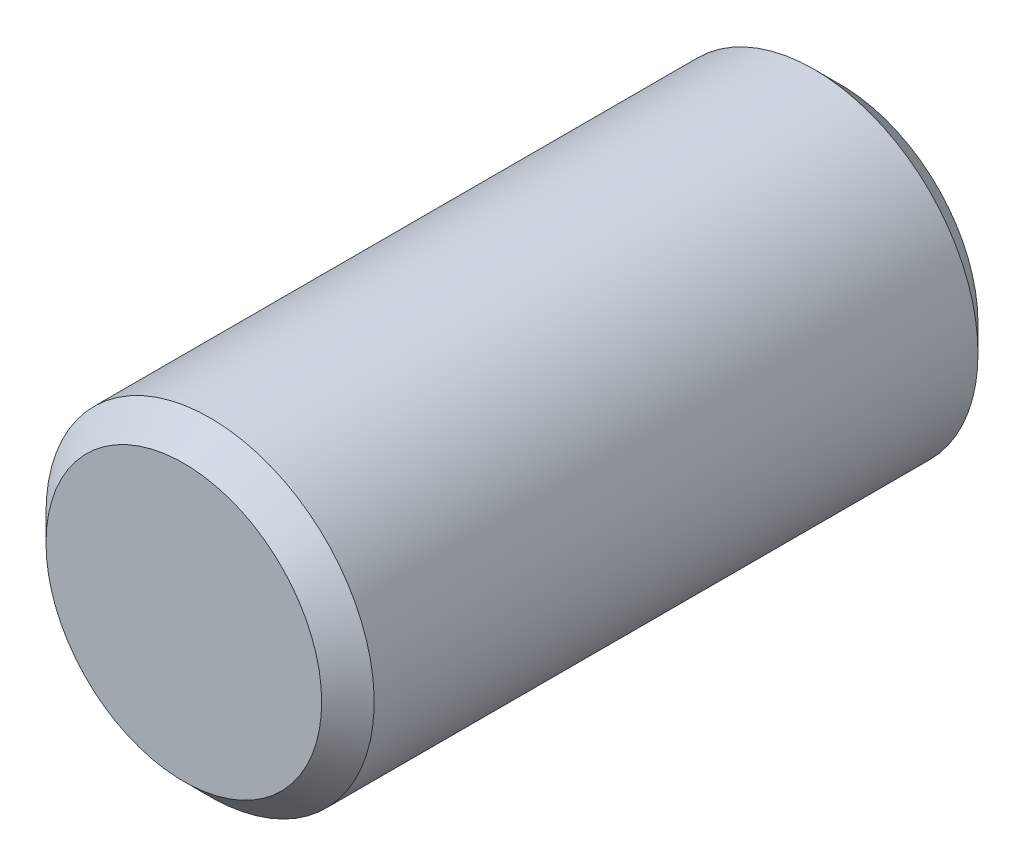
ISO-10303-21;
HEADER;
FILE_DESCRIPTION(('STEP AP214'),'2;1');
FILE_NAME('part.step','',(''),(''),'','','');
FILE_SCHEMA(('AUTOMOTIVE_DESIGN { 1 0 10303 214 1 1 1 1 }'));
ENDSEC;
DATA;
#1=APPLICATION_CONTEXT('core data for automotive mechanical design processes');
#2=APPLICATION_PROTOCOL_DEFINITION('international standard','automotive_design',2000,#1);
#3=PRODUCT_CONTEXT('',#1,'mechanical');
#4=PRODUCT('Part','Part','',(#3));
#5=PRODUCT_RELATED_PRODUCT_CATEGORY('part','',(#4));
#6=PRODUCT_DEFINITION_FORMATION('','',#4);
#7=PRODUCT_DEFINITION_CONTEXT('part definition',#1,'design');
#8=PRODUCT_DEFINITION('design','',#6,#7);
#9=PRODUCT_DEFINITION_SHAPE('','',#8);
#10=(LENGTH_UNIT() NAMED_UNIT(*) SI_UNIT(.MILLI.,.METRE.));
#11=(NAMED_UNIT(*) PLANE_ANGLE_UNIT() SI_UNIT($,.RADIAN.));
#12=(NAMED_UNIT(*) SI_UNIT($,.STERADIAN.) SOLID_ANGLE_UNIT());
#13=UNCERTAINTY_MEASURE_WITH_UNIT(LENGTH_MEASURE(1.E-05),#10,'distance_accuracy_value','');
#14=(GEOMETRIC_REPRESENTATION_CONTEXT(3) GLOBAL_UNCERTAINTY_ASSIGNED_CONTEXT((#13)) GLOBAL_UNIT_ASSIGNED_CONTEXT((#10,
#11,#12)) REPRESENTATION_CONTEXT('',''));
#15=CARTESIAN_POINT('',(0.,0.,0.));
#16=DIRECTION('',(0.,0.,1.));
#17=DIRECTION('',(1.,0.,0.));
#18=AXIS2_PLACEMENT_3D('',#15,#16,#17);
#19=CARTESIAN_POINT('',(0.,0.,5.));
#20=DIRECTION('',(0.,0.,-1.));
#21=DIRECTION('',(-1.,0.,0.));
#22=AXIS2_PLACEMENT_3D('',#19,#20,#21);
#23=CYLINDRICAL_SURFACE('',#22,1.25);
#24=CARTESIAN_POINT('',(0.,0.,0.200000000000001));
#25=DIRECTION('',(0.,0.,1.));
#26=DIRECTION('',(1.,0.,0.));
#27=AXIS2_PLACEMENT_3D('',#24,#25,#26);
#28=CIRCLE('',#27,1.25);
#29=CARTESIAN_POINT('',(1.25,0.,0.200000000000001));
#30=VERTEX_POINT('',#29);
#31=EDGE_CURVE('E371',#30,#30,#28,.T.);
#32=ORIENTED_EDGE('',*,*,#31,.T.);
#33=EDGE_LOOP('',(#32));
#34=FACE_BOUND('',#33,.T.);
#35=CARTESIAN_POINT('',(0.,0.,4.8));
#36=DIRECTION('',(0.,0.,1.));
#37=DIRECTION('',(1.,0.,0.));
#38=AXIS2_PLACEMENT_3D('',#35,#36,#37);
#39=CIRCLE('',#38,1.25);
#40=CARTESIAN_POINT('',(-1.25,0.,4.8));
#41=VERTEX_POINT('',#40);
#42=EDGE_CURVE('E375',#41,#41,#39,.F.);
#43=ORIENTED_EDGE('',*,*,#42,.T.);
#44=EDGE_LOOP('',(#43));
#45=FACE_BOUND('',#44,.T.);
#46=ADVANCED_FACE('F361',(#34,#45),#23,.T.);
#47=CARTESIAN_POINT('',(0.,0.,5.));
#48=DIRECTION('',(0.,0.,1.));
#49=DIRECTION('',(1.,0.,0.));
#50=AXIS2_PLACEMENT_3D('',#47,#48,#49);
#51=PLANE('',#50);
#52=CARTESIAN_POINT('',(0.,0.,5.));
#53=DIRECTION('',(0.,0.,1.));
#54=DIRECTION('',(1.,0.,0.));
#55=AXIS2_PLACEMENT_3D('',#52,#53,#54);
#56=CIRCLE('',#55,1.05);
#57=CARTESIAN_POINT('',(-1.05,0.,5.));
#58=VERTEX_POINT('',#57);
#59=EDGE_CURVE('E10',#58,#58,#56,.T.);
#60=ORIENTED_EDGE('',*,*,#59,.T.);
#61=EDGE_LOOP('',(#60));
#62=FACE_BOUND('',#61,.T.);
#63=ADVANCED_FACE('F394',(#62),#51,.T.);
#64=CARTESIAN_POINT('',(0.,0.,0.));
#65=DIRECTION('',(0.,0.,1.));
#66=DIRECTION('',(1.,0.,0.));
#67=AXIS2_PLACEMENT_3D('',#64,#65,#66);
#68=PLANE('',#67);
#69=CARTESIAN_POINT('',(0.,0.,0.));
#70=DIRECTION('',(0.,0.,1.));
#71=DIRECTION('',(1.,0.,0.));
#72=AXIS2_PLACEMENT_3D('',#69,#70,#71);
#73=CIRCLE('',#72,1.05);
#74=CARTESIAN_POINT('',(1.05,0.,0.));
#75=VERTEX_POINT('',#74);
#76=EDGE_CURVE('E367',#75,#75,#73,.F.);
#77=ORIENTED_EDGE('',*,*,#76,.T.);
#78=EDGE_LOOP('',(#77));
#79=FACE_BOUND('',#78,.T.);
#80=ADVANCED_FACE('F390',(#79),#68,.F.);
#81=CARTESIAN_POINT('',(0.,0.,0.200000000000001));
#82=DIRECTION('',(0.,0.,1.));
#83=DIRECTION('',(1.,0.,0.));
#84=AXIS2_PLACEMENT_3D('',#81,#82,#83);
#85=CONICAL_SURFACE('',#84,1.25,0.785398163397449);
#86=ORIENTED_EDGE('',*,*,#76,.F.);
#87=EDGE_LOOP('',(#86));
#88=FACE_BOUND('',#87,.T.);
#89=ORIENTED_EDGE('',*,*,#31,.F.);
#90=EDGE_LOOP('',(#89));
#91=FACE_BOUND('',#90,.T.);
#92=ADVANCED_FACE('F385',(#88,#91),#85,.T.);
#93=CARTESIAN_POINT('',(0.,0.,5.));
#94=DIRECTION('',(0.,0.,-1.));
#95=DIRECTION('',(-1.,0.,0.));
#96=AXIS2_PLACEMENT_3D('',#93,#94,#95);
#97=CONICAL_SURFACE('',#96,1.05,0.785398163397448);
#98=CARTESIAN_POINT('',(-1.25,0.,4.8));
#99=CARTESIAN_POINT('',(-1.24791666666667,0.,4.80208333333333));
#100=CARTESIAN_POINT('',(-1.24583333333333,0.,4.80416666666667));
#101=CARTESIAN_POINT('',(-1.24166666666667,0.,4.80833333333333));
#102=CARTESIAN_POINT('',(-1.23958333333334,0.,4.81041666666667));
#103=CARTESIAN_POINT('',(-1.23541666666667,0.,4.81458333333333));
#104=CARTESIAN_POINT('',(-1.23333333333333,0.,4.81666666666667));
#105=CARTESIAN_POINT('',(-1.22916666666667,0.,4.82083333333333));
#106=CARTESIAN_POINT('',(-1.22708333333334,0.,4.82291666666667));
#107=CARTESIAN_POINT('',(-1.22291666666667,0.,4.82708333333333));
#108=CARTESIAN_POINT('',(-1.22083333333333,0.,4.82916666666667));
#109=CARTESIAN_POINT('',(-1.21666666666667,0.,4.83333333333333));
#110=CARTESIAN_POINT('',(-1.21458333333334,0.,4.83541666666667));
#111=CARTESIAN_POINT('',(-1.21041666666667,0.,4.83958333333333));
#112=CARTESIAN_POINT('',(-1.20833333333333,0.,4.84166666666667));
#113=CARTESIAN_POINT('',(-1.20416666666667,0.,4.84583333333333));
#114=CARTESIAN_POINT('',(-1.20208333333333,0.,4.84791666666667));
#115=CARTESIAN_POINT('',(-1.19791666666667,0.,4.85208333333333));
#116=CARTESIAN_POINT('',(-1.19583333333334,0.,4.85416666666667));
#117=CARTESIAN_POINT('',(-1.19166666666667,0.,4.85833333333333));
#118=CARTESIAN_POINT('',(-1.18958333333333,0.,4.86041666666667));
#119=CARTESIAN_POINT('',(-1.18541666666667,0.,4.86458333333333));
#120=CARTESIAN_POINT('',(-1.18333333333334,0.,4.86666666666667));
#121=CARTESIAN_POINT('',(-1.17916666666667,0.,4.87083333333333));
#122=CARTESIAN_POINT('',(-1.17708333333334,0.,4.87291666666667));
#123=CARTESIAN_POINT('',(-1.17291666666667,0.,4.87708333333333));
#124=CARTESIAN_POINT('',(-1.17083333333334,0.,4.87916666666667));
#125=CARTESIAN_POINT('',(-1.16666666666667,0.,4.88333333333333));
#126=CARTESIAN_POINT('',(-1.16458333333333,0.,4.88541666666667));
#127=CARTESIAN_POINT('',(-1.16041666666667,0.,4.88958333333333));
#128=CARTESIAN_POINT('',(-1.15833333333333,0.,4.89166666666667));
#129=CARTESIAN_POINT('',(-1.15416666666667,0.,4.89583333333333));
#130=CARTESIAN_POINT('',(-1.15208333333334,0.,4.89791666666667));
#131=CARTESIAN_POINT('',(-1.14791666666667,0.,4.90208333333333));
#132=CARTESIAN_POINT('',(-1.14583333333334,0.,4.90416666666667));
#133=CARTESIAN_POINT('',(-1.14166666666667,0.,4.90833333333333));
#134=CARTESIAN_POINT('',(-1.13958333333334,0.,4.91041666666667));
#135=CARTESIAN_POINT('',(-1.13541666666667,0.,4.91458333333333));
#136=CARTESIAN_POINT('',(-1.13333333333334,0.,4.91666666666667));
#137=CARTESIAN_POINT('',(-1.12916666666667,0.,4.92083333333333));
#138=CARTESIAN_POINT('',(-1.12708333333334,0.,4.92291666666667));
#139=CARTESIAN_POINT('',(-1.12291666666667,0.,4.92708333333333));
#140=CARTESIAN_POINT('',(-1.12083333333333,0.,4.92916666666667));
#141=CARTESIAN_POINT('',(-1.11666666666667,0.,4.93333333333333));
#142=CARTESIAN_POINT('',(-1.11458333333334,0.,4.93541666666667));
#143=CARTESIAN_POINT('',(-1.11041666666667,0.,4.93958333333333));
#144=CARTESIAN_POINT('',(-1.10833333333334,0.,4.94166666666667));
#145=CARTESIAN_POINT('',(-1.10416666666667,0.,4.94583333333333));
#146=CARTESIAN_POINT('',(-1.10208333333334,0.,4.94791666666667));
#147=CARTESIAN_POINT('',(-1.09791666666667,0.,4.95208333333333));
#148=CARTESIAN_POINT('',(-1.09583333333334,0.,4.95416666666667));
#149=CARTESIAN_POINT('',(-1.09166666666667,0.,4.95833333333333));
#150=CARTESIAN_POINT('',(-1.08958333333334,0.,4.96041666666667));
#151=CARTESIAN_POINT('',(-1.08541666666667,0.,4.96458333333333));
#152=CARTESIAN_POINT('',(-1.08333333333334,0.,4.96666666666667));
#153=CARTESIAN_POINT('',(-1.07916666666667,0.,4.97083333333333));
#154=CARTESIAN_POINT('',(-1.07708333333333,0.,4.97291666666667));
#155=CARTESIAN_POINT('',(-1.07291666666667,0.,4.97708333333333));
#156=CARTESIAN_POINT('',(-1.07083333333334,0.,4.97916666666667));
#157=CARTESIAN_POINT('',(-1.06666666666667,0.,4.98333333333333));
#158=CARTESIAN_POINT('',(-1.06458333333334,0.,4.98541666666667));
#159=CARTESIAN_POINT('',(-1.06041666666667,0.,4.98958333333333));
#160=CARTESIAN_POINT('',(-1.05833333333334,0.,4.99166666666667));
#161=CARTESIAN_POINT('',(-1.05416666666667,0.,4.99583333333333));
#162=CARTESIAN_POINT('',(-1.05208333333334,0.,4.99791666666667));
#163=CARTESIAN_POINT('',(-1.05,0.,5.));
#164=B_SPLINE_CURVE_WITH_KNOTS('',3,(#98,#99,#100,#101,#102,#103,#104,#105,#106,#107,#108,#109,
#110,#111,#112,#113,#114,#115,#116,#117,#118,#119,#120,#121,#122,#123,#124,#125,#126,#127,#128,
#129,#130,#131,#132,#133,#134,#135,#136,#137,#138,#139,#140,#141,#142,#143,#144,#145,#146,#147,
#148,#149,#150,#151,#152,#153,#154,#155,#156,#157,#158,#159,#160,#161,#162,#163),.UNSPECIFIED.,
.F.,.F.,(4,2,2,2,2,2,2,2,2,2,2,2,2,2,2,2,2,2,2,2,2,2,2,2,2,2,2,2,2,2,2,2,4),(0.,
0.00883883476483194,0.0176776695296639,0.0265165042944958,0.0353553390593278,0.0441941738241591,
0.053033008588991,0.0618718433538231,0.0707106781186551,0.079549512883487,0.0883883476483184,
0.0972271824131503,0.106066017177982,0.114904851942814,0.123743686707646,0.132582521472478,
0.14142135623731,0.150260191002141,0.159099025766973,0.167937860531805,0.176776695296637,
0.185615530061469,0.194454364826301,0.203293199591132,0.212132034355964,0.220970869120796,
0.229809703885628,0.23864853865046,0.247487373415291,0.256326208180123,0.265165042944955,
0.274003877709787,0.282842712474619),.UNSPECIFIED.);
#165=EDGE_CURVE('BSEAM382',#41,#58,#164,.T.);
#166=ORIENTED_EDGE('',*,*,#42,.F.);
#167=ORIENTED_EDGE('',*,*,#59,.F.);
#168=ORIENTED_EDGE('',*,*,#165,.T.);
#169=ORIENTED_EDGE('',*,*,#165,.F.);
#170=EDGE_LOOP('',(#166,#168,#167,#169));
#171=FACE_BOUND('',#170,.T.);
#172=ADVANCED_FACE('F382',(#171),#97,.T.);
#173=CLOSED_SHELL('',(#46,#63,#80,#92,#172));
#174=MANIFOLD_SOLID_BREP('B2',#173);
#175=ADVANCED_BREP_SHAPE_REPRESENTATION('',(#18,#174),#14);
#176=SHAPE_DEFINITION_REPRESENTATION(#9,#175);
ENDSEC;
END-ISO-10303-21;
